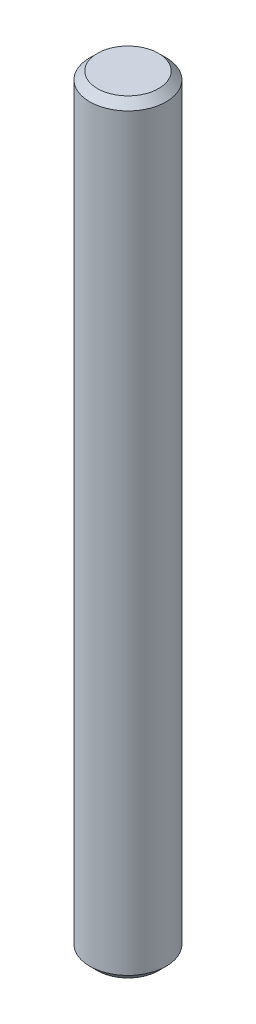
from build123d import *

# Parameters (mm, degrees)
SKETCH1_R      = 2
EXTRUDE1_DEPTH = 40
CHAMFER1_SIZE  = 0.4


with BuildPart() as part:
    # Sketch1 → Extrude1 (new body)
    with BuildSketch(Plane(origin=(0, 0, 0), x_dir=(1, 0, 0), z_dir=(0, 1, 0))):
        with Locations(Location((0, 0, 0), (0, 0, 270))):
            Circle(SKETCH1_R)
    extrude(amount=EXTRUDE1_DEPTH)

    # Chamfer1
    chamfer1_edges = [part.edges().sort_by_distance(p)[0] for p in [
        (0, 0, -2),
        (0, 40, -2),
    ]]
    chamfer(chamfer1_edges, length=CHAMFER1_SIZE)


solid = part.part
